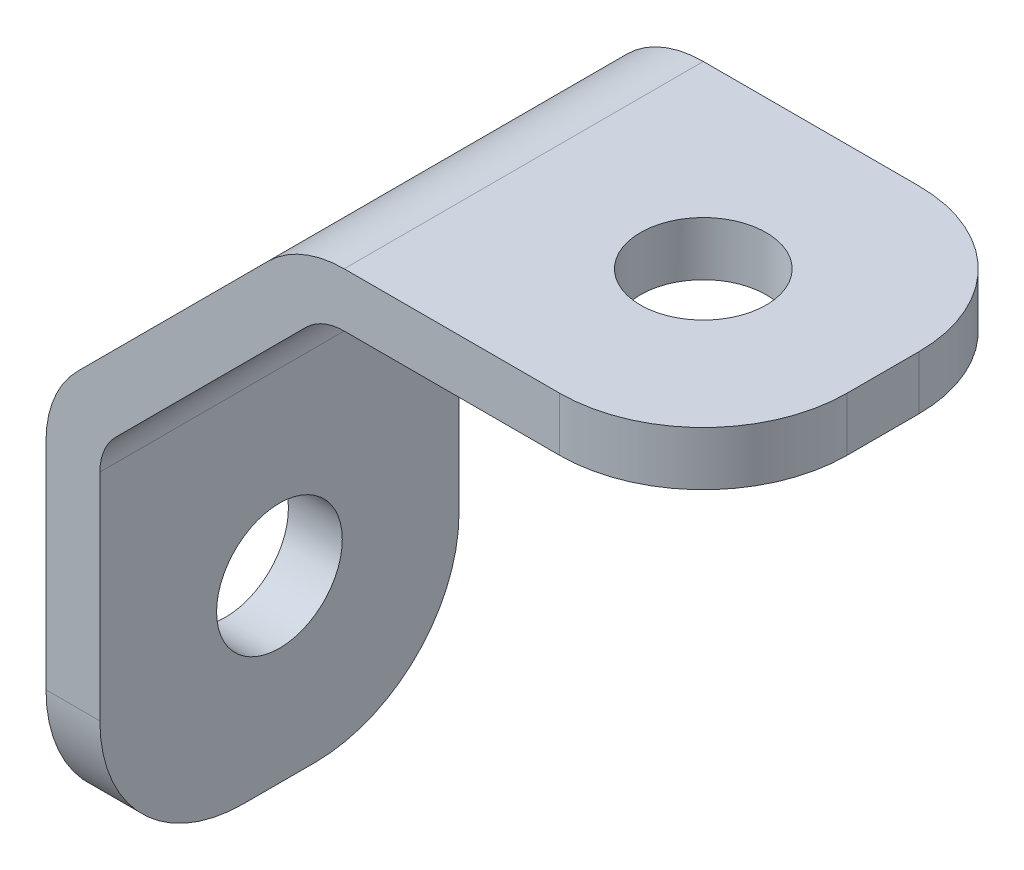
ISO-10303-21;
HEADER;
FILE_DESCRIPTION(('STEP AP214'),'2;1');
FILE_NAME('part.step','',(''),(''),'','','');
FILE_SCHEMA(('AUTOMOTIVE_DESIGN { 1 0 10303 214 1 1 1 1 }'));
ENDSEC;
DATA;
#1=APPLICATION_CONTEXT('core data for automotive mechanical design processes');
#2=APPLICATION_PROTOCOL_DEFINITION('international standard','automotive_design',2000,#1);
#3=PRODUCT_CONTEXT('',#1,'mechanical');
#4=PRODUCT('Part','Part','',(#3));
#5=PRODUCT_RELATED_PRODUCT_CATEGORY('part','',(#4));
#6=PRODUCT_DEFINITION_FORMATION('','',#4);
#7=PRODUCT_DEFINITION_CONTEXT('part definition',#1,'design');
#8=PRODUCT_DEFINITION('design','',#6,#7);
#9=PRODUCT_DEFINITION_SHAPE('','',#8);
#10=(LENGTH_UNIT() NAMED_UNIT(*) SI_UNIT(.MILLI.,.METRE.));
#11=(NAMED_UNIT(*) PLANE_ANGLE_UNIT() SI_UNIT($,.RADIAN.));
#12=(NAMED_UNIT(*) SI_UNIT($,.STERADIAN.) SOLID_ANGLE_UNIT());
#13=UNCERTAINTY_MEASURE_WITH_UNIT(LENGTH_MEASURE(1.E-05),#10,'distance_accuracy_value','');
#14=(GEOMETRIC_REPRESENTATION_CONTEXT(3) GLOBAL_UNCERTAINTY_ASSIGNED_CONTEXT((#13)) GLOBAL_UNIT_ASSIGNED_CONTEXT((#10,
#11,#12)) REPRESENTATION_CONTEXT('',''));
#15=CARTESIAN_POINT('',(0.,0.,0.));
#16=DIRECTION('',(0.,0.,1.));
#17=DIRECTION('',(1.,0.,0.));
#18=AXIS2_PLACEMENT_3D('',#15,#16,#17);
#19=CARTESIAN_POINT('',(35.1066017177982,23.6066017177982,10.));
#20=DIRECTION('',(0.,-1.,0.));
#21=DIRECTION('',(0.,0.,-1.));
#22=AXIS2_PLACEMENT_3D('',#19,#20,#21);
#23=PLANE('',#22);
#24=CARTESIAN_POINT('',(25.1066017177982,23.6066017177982,0.));
#25=DIRECTION('',(0.,-1.,0.));
#26=DIRECTION('',(0.,0.,-1.));
#27=AXIS2_PLACEMENT_3D('',#24,#25,#26);
#28=CIRCLE('',#27,3.5);
#29=CARTESIAN_POINT('',(25.1066017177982,23.6066017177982,-3.5));
#30=VERTEX_POINT('',#29);
#31=EDGE_CURVE('E294',#30,#30,#28,.T.);
#32=ORIENTED_EDGE('',*,*,#31,.F.);
#33=EDGE_LOOP('',(#32));
#34=FACE_BOUND('',#33,.T.);
#35=DIRECTION('',(-1.,0.,0.));
#36=VECTOR('',#35,1.);
#37=CARTESIAN_POINT('',(35.1066017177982,23.6066017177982,-10.));
#38=LINE('',#37,#36);
#39=CARTESIAN_POINT('',(27.1066017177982,23.6066017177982,-10.));
#40=VERTEX_POINT('',#39);
#41=CARTESIAN_POINT('',(15.1066017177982,23.6066017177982,-10.));
#42=VERTEX_POINT('',#41);
#43=EDGE_CURVE('E159',#40,#42,#38,.T.);
#44=ORIENTED_EDGE('',*,*,#43,.F.);
#45=CARTESIAN_POINT('',(27.1066017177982,23.6066017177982,-2.));
#46=DIRECTION('',(0.,-1.,0.));
#47=DIRECTION('',(0.,0.,-1.));
#48=AXIS2_PLACEMENT_3D('',#45,#46,#47);
#49=CIRCLE('',#48,8.);
#50=CARTESIAN_POINT('',(35.1066017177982,23.6066017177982,-2.));
#51=VERTEX_POINT('',#50);
#52=EDGE_CURVE('E45',#40,#51,#49,.T.);
#53=ORIENTED_EDGE('',*,*,#52,.T.);
#54=DIRECTION('',(0.,0.,-1.));
#55=VECTOR('',#54,1.);
#56=CARTESIAN_POINT('',(35.1066017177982,23.6066017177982,10.));
#57=LINE('',#56,#55);
#58=CARTESIAN_POINT('',(35.1066017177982,23.6066017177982,2.));
#59=VERTEX_POINT('',#58);
#60=EDGE_CURVE('E216',#59,#51,#57,.T.);
#61=ORIENTED_EDGE('',*,*,#60,.F.);
#62=CARTESIAN_POINT('',(27.1066017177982,23.6066017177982,2.));
#63=DIRECTION('',(0.,-1.,0.));
#64=DIRECTION('',(0.,0.,-1.));
#65=AXIS2_PLACEMENT_3D('',#62,#63,#64);
#66=CIRCLE('',#65,8.);
#67=CARTESIAN_POINT('',(27.1066017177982,23.6066017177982,10.));
#68=VERTEX_POINT('',#67);
#69=EDGE_CURVE('E288',#59,#68,#66,.T.);
#70=ORIENTED_EDGE('',*,*,#69,.T.);
#71=DIRECTION('',(-1.,0.,0.));
#72=VECTOR('',#71,1.);
#73=CARTESIAN_POINT('',(35.1066017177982,23.6066017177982,10.));
#74=LINE('',#73,#72);
#75=CARTESIAN_POINT('',(15.1066017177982,23.6066017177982,10.));
#76=VERTEX_POINT('',#75);
#77=EDGE_CURVE('E190',#68,#76,#74,.T.);
#78=ORIENTED_EDGE('',*,*,#77,.T.);
#79=DIRECTION('',(0.,0.,-1.));
#80=VECTOR('',#79,1.);
#81=CARTESIAN_POINT('',(15.1066017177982,23.6066017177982,10.));
#82=LINE('',#81,#80);
#83=EDGE_CURVE('E213',#76,#42,#82,.T.);
#84=ORIENTED_EDGE('',*,*,#83,.T.);
#85=EDGE_LOOP('',(#44,#53,#61,#70,#78,#84));
#86=FACE_BOUND('',#85,.T.);
#87=ADVANCED_FACE('F30',(#34,#86),#23,.T.);
#88=CARTESIAN_POINT('',(15.1066017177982,26.6066017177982,10.));
#89=DIRECTION('',(0.,1.,0.));
#90=DIRECTION('',(0.,0.,1.));
#91=AXIS2_PLACEMENT_3D('',#88,#89,#90);
#92=PLANE('',#91);
#93=CARTESIAN_POINT('',(25.1066017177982,26.6066017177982,0.));
#94=DIRECTION('',(0.,1.,0.));
#95=DIRECTION('',(0.,0.,1.));
#96=AXIS2_PLACEMENT_3D('',#93,#94,#95);
#97=CIRCLE('',#96,3.5);
#98=CARTESIAN_POINT('',(25.1066017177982,26.6066017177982,3.5));
#99=VERTEX_POINT('',#98);
#100=EDGE_CURVE('E290',#99,#99,#97,.T.);
#101=ORIENTED_EDGE('',*,*,#100,.F.);
#102=EDGE_LOOP('',(#101));
#103=FACE_BOUND('',#102,.T.);
#104=DIRECTION('',(0.,0.,-1.));
#105=VECTOR('',#104,1.);
#106=CARTESIAN_POINT('',(35.1066017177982,26.6066017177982,10.));
#107=LINE('',#106,#105);
#108=CARTESIAN_POINT('',(35.1066017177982,26.6066017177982,2.));
#109=VERTEX_POINT('',#108);
#110=CARTESIAN_POINT('',(35.1066017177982,26.6066017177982,-2.));
#111=VERTEX_POINT('',#110);
#112=EDGE_CURVE('E152',#109,#111,#107,.T.);
#113=ORIENTED_EDGE('',*,*,#112,.T.);
#114=CARTESIAN_POINT('',(27.1066017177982,26.6066017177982,-2.));
#115=DIRECTION('',(0.,1.,0.));
#116=DIRECTION('',(0.,0.,1.));
#117=AXIS2_PLACEMENT_3D('',#114,#115,#116);
#118=CIRCLE('',#117,8.);
#119=CARTESIAN_POINT('',(27.1066017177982,26.6066017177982,-10.));
#120=VERTEX_POINT('',#119);
#121=EDGE_CURVE('E141',#111,#120,#118,.T.);
#122=ORIENTED_EDGE('',*,*,#121,.T.);
#123=DIRECTION('',(1.,0.,0.));
#124=VECTOR('',#123,1.);
#125=CARTESIAN_POINT('',(15.1066017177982,26.6066017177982,-10.));
#126=LINE('',#125,#124);
#127=CARTESIAN_POINT('',(15.1066017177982,26.6066017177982,-10.));
#128=VERTEX_POINT('',#127);
#129=EDGE_CURVE('E150',#128,#120,#126,.T.);
#130=ORIENTED_EDGE('',*,*,#129,.F.);
#131=DIRECTION('',(0.,0.,-1.));
#132=VECTOR('',#131,1.);
#133=CARTESIAN_POINT('',(15.1066017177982,26.6066017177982,10.));
#134=LINE('',#133,#132);
#135=CARTESIAN_POINT('',(15.1066017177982,26.6066017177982,10.));
#136=VERTEX_POINT('',#135);
#137=EDGE_CURVE('E220',#136,#128,#134,.T.);
#138=ORIENTED_EDGE('',*,*,#137,.F.);
#139=DIRECTION('',(1.,0.,0.));
#140=VECTOR('',#139,1.);
#141=CARTESIAN_POINT('',(15.1066017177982,26.6066017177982,10.));
#142=LINE('',#141,#140);
#143=CARTESIAN_POINT('',(27.1066017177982,26.6066017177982,10.));
#144=VERTEX_POINT('',#143);
#145=EDGE_CURVE('E187',#136,#144,#142,.T.);
#146=ORIENTED_EDGE('',*,*,#145,.T.);
#147=CARTESIAN_POINT('',(27.1066017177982,26.6066017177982,2.));
#148=DIRECTION('',(0.,1.,0.));
#149=DIRECTION('',(0.,0.,1.));
#150=AXIS2_PLACEMENT_3D('',#147,#148,#149);
#151=CIRCLE('',#150,8.);
#152=EDGE_CURVE('E52',#144,#109,#151,.T.);
#153=ORIENTED_EDGE('',*,*,#152,.T.);
#154=EDGE_LOOP('',(#113,#122,#130,#138,#146,#153));
#155=FACE_BOUND('',#154,.T.);
#156=ADVANCED_FACE('F149',(#103,#155),#92,.T.);
#157=CARTESIAN_POINT('',(4.5,10.,10.));
#158=DIRECTION('',(0.,0.,1.));
#159=DIRECTION('',(1.,0.,0.));
#160=AXIS2_PLACEMENT_3D('',#157,#158,#159);
#161=PLANE('',#160);
#162=ORIENTED_EDGE('',*,*,#77,.F.);
#163=DIRECTION('',(0.,1.,0.));
#164=VECTOR('',#163,1.);
#165=CARTESIAN_POINT('',(27.1066017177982,-10.,10.));
#166=LINE('',#165,#164);
#167=EDGE_CURVE('E38',#68,#144,#166,.T.);
#168=ORIENTED_EDGE('',*,*,#167,.T.);
#169=ORIENTED_EDGE('',*,*,#145,.F.);
#170=CARTESIAN_POINT('',(15.1066017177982,20.6066017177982,10.));
#171=DIRECTION('',(0.,0.,1.));
#172=DIRECTION('',(1.,0.,0.));
#173=AXIS2_PLACEMENT_3D('',#170,#171,#172);
#174=CIRCLE('',#173,6.);
#175=CARTESIAN_POINT('',(10.863961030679,24.8492424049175,10.));
#176=VERTEX_POINT('',#175);
#177=EDGE_CURVE('E185',#136,#176,#174,.T.);
#178=ORIENTED_EDGE('',*,*,#177,.T.);
#179=DIRECTION('',(-0.707106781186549,-0.707106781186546,0.));
#180=VECTOR('',#179,1.);
#181=CARTESIAN_POINT('',(10.863961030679,24.8492424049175,10.));
#182=LINE('',#181,#180);
#183=CARTESIAN_POINT('',(0.257359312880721,14.2426406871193,10.));
#184=VERTEX_POINT('',#183);
#185=EDGE_CURVE('E183',#176,#184,#182,.T.);
#186=ORIENTED_EDGE('',*,*,#185,.T.);
#187=CARTESIAN_POINT('',(4.5,10.,10.));
#188=DIRECTION('',(0.,0.,1.));
#189=DIRECTION('',(1.,0.,0.));
#190=AXIS2_PLACEMENT_3D('',#187,#188,#189);
#191=CIRCLE('',#190,6.);
#192=CARTESIAN_POINT('',(-1.5,10.,10.));
#193=VERTEX_POINT('',#192);
#194=EDGE_CURVE('E181',#184,#193,#191,.T.);
#195=ORIENTED_EDGE('',*,*,#194,.T.);
#196=DIRECTION('',(0.,-1.,0.));
#197=VECTOR('',#196,1.);
#198=CARTESIAN_POINT('',(-1.5,10.,10.));
#199=LINE('',#198,#197);
#200=CARTESIAN_POINT('',(-1.5,-2.00000000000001,10.));
#201=VERTEX_POINT('',#200);
#202=EDGE_CURVE('E178',#193,#201,#199,.T.);
#203=ORIENTED_EDGE('',*,*,#202,.T.);
#204=DIRECTION('',(-1.,0.,0.));
#205=VECTOR('',#204,1.);
#206=CARTESIAN_POINT('',(35.1066017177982,-2.00000000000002,10.));
#207=LINE('',#206,#205);
#208=CARTESIAN_POINT('',(1.5,-2.00000000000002,10.));
#209=VERTEX_POINT('',#208);
#210=EDGE_CURVE('E234',#209,#201,#207,.T.);
#211=ORIENTED_EDGE('',*,*,#210,.F.);
#212=DIRECTION('',(0.,-1.,0.));
#213=VECTOR('',#212,1.);
#214=CARTESIAN_POINT('',(1.5,10.,10.));
#215=LINE('',#214,#213);
#216=CARTESIAN_POINT('',(1.5,10.,10.));
#217=VERTEX_POINT('',#216);
#218=EDGE_CURVE('E200',#217,#209,#215,.T.);
#219=ORIENTED_EDGE('',*,*,#218,.F.);
#220=CARTESIAN_POINT('',(4.5,10.,10.));
#221=DIRECTION('',(0.,0.,-1.));
#222=DIRECTION('',(-1.,0.,0.));
#223=AXIS2_PLACEMENT_3D('',#220,#221,#222);
#224=CIRCLE('',#223,3.);
#225=CARTESIAN_POINT('',(2.37867965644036,12.1213203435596,10.));
#226=VERTEX_POINT('',#225);
#227=EDGE_CURVE('E198',#217,#226,#224,.T.);
#228=ORIENTED_EDGE('',*,*,#227,.T.);
#229=DIRECTION('',(-0.707106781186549,-0.707106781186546,0.));
#230=VECTOR('',#229,1.);
#231=CARTESIAN_POINT('',(12.9852813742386,22.7279220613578,10.));
#232=LINE('',#231,#230);
#233=CARTESIAN_POINT('',(12.9852813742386,22.7279220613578,10.));
#234=VERTEX_POINT('',#233);
#235=EDGE_CURVE('E195',#234,#226,#232,.T.);
#236=ORIENTED_EDGE('',*,*,#235,.F.);
#237=CARTESIAN_POINT('',(15.1066017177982,20.6066017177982,10.));
#238=DIRECTION('',(0.,0.,-1.));
#239=DIRECTION('',(-1.,0.,0.));
#240=AXIS2_PLACEMENT_3D('',#237,#238,#239);
#241=CIRCLE('',#240,3.);
#242=EDGE_CURVE('E192',#234,#76,#241,.T.);
#243=ORIENTED_EDGE('',*,*,#242,.T.);
#244=EDGE_LOOP('',(#162,#168,#169,#178,#186,#195,#203,#211,#219,#228,#236,#243));
#245=FACE_BOUND('',#244,.T.);
#246=ADVANCED_FACE('F238',(#245),#161,.T.);
#247=CARTESIAN_POINT('',(1.5,10.,10.));
#248=DIRECTION('',(1.,0.,0.));
#249=DIRECTION('',(0.,1.,0.));
#250=AXIS2_PLACEMENT_3D('',#247,#248,#249);
#251=PLANE('',#250);
#252=CARTESIAN_POINT('',(1.5,0.,0.));
#253=DIRECTION('',(1.,0.,0.));
#254=DIRECTION('',(0.,1.,0.));
#255=AXIS2_PLACEMENT_3D('',#252,#253,#254);
#256=CIRCLE('',#255,3.5);
#257=CARTESIAN_POINT('',(1.5,3.5,0.));
#258=VERTEX_POINT('',#257);
#259=EDGE_CURVE('E317',#258,#258,#256,.T.);
#260=ORIENTED_EDGE('',*,*,#259,.F.);
#261=EDGE_LOOP('',(#260));
#262=FACE_BOUND('',#261,.T.);
#263=ORIENTED_EDGE('',*,*,#218,.T.);
#264=CARTESIAN_POINT('',(1.5,-2.,2.));
#265=DIRECTION('',(1.,0.,0.));
#266=DIRECTION('',(0.,1.,0.));
#267=AXIS2_PLACEMENT_3D('',#264,#265,#266);
#268=CIRCLE('',#267,8.);
#269=CARTESIAN_POINT('',(1.49999999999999,-10.,2.));
#270=VERTEX_POINT('',#269);
#271=EDGE_CURVE('E268',#209,#270,#268,.T.);
#272=ORIENTED_EDGE('',*,*,#271,.T.);
#273=DIRECTION('',(0.,0.,-1.));
#274=VECTOR('',#273,1.);
#275=CARTESIAN_POINT('',(1.49999999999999,-10.,10.));
#276=LINE('',#275,#274);
#277=CARTESIAN_POINT('',(1.49999999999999,-10.,-2.00000000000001));
#278=VERTEX_POINT('',#277);
#279=EDGE_CURVE('E204',#270,#278,#276,.T.);
#280=ORIENTED_EDGE('',*,*,#279,.T.);
#281=CARTESIAN_POINT('',(1.5,-2.,-2.));
#282=DIRECTION('',(1.,0.,0.));
#283=DIRECTION('',(0.,1.,0.));
#284=AXIS2_PLACEMENT_3D('',#281,#282,#283);
#285=CIRCLE('',#284,8.);
#286=CARTESIAN_POINT('',(1.49999999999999,-2.00000000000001,-10.));
#287=VERTEX_POINT('',#286);
#288=EDGE_CURVE('E312',#278,#287,#285,.T.);
#289=ORIENTED_EDGE('',*,*,#288,.T.);
#290=DIRECTION('',(0.,-1.,0.));
#291=VECTOR('',#290,1.);
#292=CARTESIAN_POINT('',(1.5,10.,-10.));
#293=LINE('',#292,#291);
#294=CARTESIAN_POINT('',(1.5,10.,-10.));
#295=VERTEX_POINT('',#294);
#296=EDGE_CURVE('E175',#295,#287,#293,.T.);
#297=ORIENTED_EDGE('',*,*,#296,.F.);
#298=DIRECTION('',(0.,0.,-1.));
#299=VECTOR('',#298,1.);
#300=CARTESIAN_POINT('',(1.5,10.,10.));
#301=LINE('',#300,#299);
#302=EDGE_CURVE('E207',#217,#295,#301,.T.);
#303=ORIENTED_EDGE('',*,*,#302,.F.);
#304=EDGE_LOOP('',(#263,#272,#280,#289,#297,#303));
#305=FACE_BOUND('',#304,.T.);
#306=ADVANCED_FACE('F267',(#262,#305),#251,.T.);
#307=CARTESIAN_POINT('',(-1.5,10.,10.));
#308=DIRECTION('',(1.,0.,0.));
#309=DIRECTION('',(0.,1.,0.));
#310=AXIS2_PLACEMENT_3D('',#307,#308,#309);
#311=PLANE('',#310);
#312=CARTESIAN_POINT('',(-1.5,0.,0.));
#313=DIRECTION('',(-1.,0.,0.));
#314=DIRECTION('',(0.,-1.,0.));
#315=AXIS2_PLACEMENT_3D('',#312,#313,#314);
#316=CIRCLE('',#315,3.5);
#317=CARTESIAN_POINT('',(-1.5,-3.5,0.));
#318=VERTEX_POINT('',#317);
#319=EDGE_CURVE('E314',#318,#318,#316,.T.);
#320=ORIENTED_EDGE('',*,*,#319,.F.);
#321=EDGE_LOOP('',(#320));
#322=FACE_BOUND('',#321,.T.);
#323=CARTESIAN_POINT('',(-1.5,-2.,2.));
#324=DIRECTION('',(-1.,0.,0.));
#325=DIRECTION('',(0.,-1.,0.));
#326=AXIS2_PLACEMENT_3D('',#323,#324,#325);
#327=CIRCLE('',#326,8.);
#328=CARTESIAN_POINT('',(-1.5,-10.,2.));
#329=VERTEX_POINT('',#328);
#330=EDGE_CURVE('E261',#329,#201,#327,.T.);
#331=ORIENTED_EDGE('',*,*,#330,.T.);
#332=ORIENTED_EDGE('',*,*,#202,.F.);
#333=DIRECTION('',(0.,0.,-1.));
#334=VECTOR('',#333,1.);
#335=CARTESIAN_POINT('',(-1.5,10.,10.));
#336=LINE('',#335,#334);
#337=CARTESIAN_POINT('',(-1.5,10.,-10.));
#338=VERTEX_POINT('',#337);
#339=EDGE_CURVE('E228',#193,#338,#336,.T.);
#340=ORIENTED_EDGE('',*,*,#339,.T.);
#341=DIRECTION('',(0.,-1.,0.));
#342=VECTOR('',#341,1.);
#343=CARTESIAN_POINT('',(-1.5,10.,-10.));
#344=LINE('',#343,#342);
#345=CARTESIAN_POINT('',(-1.5,-2.00000000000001,-10.));
#346=VERTEX_POINT('',#345);
#347=EDGE_CURVE('E320',#338,#346,#344,.T.);
#348=ORIENTED_EDGE('',*,*,#347,.T.);
#349=CARTESIAN_POINT('',(-1.5,-2.,-2.));
#350=DIRECTION('',(-1.,0.,0.));
#351=DIRECTION('',(0.,-1.,0.));
#352=AXIS2_PLACEMENT_3D('',#349,#350,#351);
#353=CIRCLE('',#352,8.);
#354=CARTESIAN_POINT('',(-1.5,-10.,-2.00000000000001));
#355=VERTEX_POINT('',#354);
#356=EDGE_CURVE('E306',#346,#355,#353,.T.);
#357=ORIENTED_EDGE('',*,*,#356,.T.);
#358=DIRECTION('',(0.,0.,-1.));
#359=VECTOR('',#358,1.);
#360=CARTESIAN_POINT('',(-1.5,-10.,10.));
#361=LINE('',#360,#359);
#362=EDGE_CURVE('E203',#329,#355,#361,.T.);
#363=ORIENTED_EDGE('',*,*,#362,.F.);
#364=EDGE_LOOP('',(#331,#332,#340,#348,#357,#363));
#365=FACE_BOUND('',#364,.T.);
#366=ADVANCED_FACE('F259',(#322,#365),#311,.F.);
#367=CARTESIAN_POINT('',(1.49999999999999,-10.,10.));
#368=DIRECTION('',(0.,-1.,0.));
#369=DIRECTION('',(0.,0.,-1.));
#370=AXIS2_PLACEMENT_3D('',#367,#368,#369);
#371=PLANE('',#370);
#372=DIRECTION('',(-1.,0.,0.));
#373=VECTOR('',#372,1.);
#374=CARTESIAN_POINT('',(35.1066017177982,-10.,2.));
#375=LINE('',#374,#373);
#376=EDGE_CURVE('E302',#270,#329,#375,.T.);
#377=ORIENTED_EDGE('',*,*,#376,.T.);
#378=ORIENTED_EDGE('',*,*,#362,.T.);
#379=DIRECTION('',(-1.,0.,0.));
#380=VECTOR('',#379,1.);
#381=CARTESIAN_POINT('',(35.1066017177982,-10.,-2.00000000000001));
#382=LINE('',#381,#380);
#383=EDGE_CURVE('E309',#278,#355,#382,.T.);
#384=ORIENTED_EDGE('',*,*,#383,.F.);
#385=ORIENTED_EDGE('',*,*,#279,.F.);
#386=EDGE_LOOP('',(#377,#378,#384,#385));
#387=FACE_BOUND('',#386,.T.);
#388=ADVANCED_FACE('F32',(#387),#371,.T.);
#389=CARTESIAN_POINT('',(4.5,10.,10.));
#390=DIRECTION('',(0.,0.,-1.));
#391=DIRECTION('',(-1.,0.,0.));
#392=AXIS2_PLACEMENT_3D('',#389,#390,#391);
#393=CYLINDRICAL_SURFACE('',#392,3.);
#394=CARTESIAN_POINT('',(4.5,10.,-10.));
#395=DIRECTION('',(0.,0.,-1.));
#396=DIRECTION('',(-1.,0.,0.));
#397=AXIS2_PLACEMENT_3D('',#394,#395,#396);
#398=CIRCLE('',#397,3.);
#399=CARTESIAN_POINT('',(2.37867965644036,12.1213203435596,-10.));
#400=VERTEX_POINT('',#399);
#401=EDGE_CURVE('E172',#295,#400,#398,.T.);
#402=ORIENTED_EDGE('',*,*,#401,.T.);
#403=DIRECTION('',(0.,0.,-1.));
#404=VECTOR('',#403,1.);
#405=CARTESIAN_POINT('',(2.37867965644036,12.1213203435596,10.));
#406=LINE('',#405,#404);
#407=EDGE_CURVE('E209',#226,#400,#406,.T.);
#408=ORIENTED_EDGE('',*,*,#407,.F.);
#409=ORIENTED_EDGE('',*,*,#227,.F.);
#410=ORIENTED_EDGE('',*,*,#302,.T.);
#411=EDGE_LOOP('',(#402,#408,#409,#410));
#412=FACE_BOUND('',#411,.T.);
#413=ADVANCED_FACE('F276',(#412),#393,.F.);
#414=CARTESIAN_POINT('',(12.9852813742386,22.7279220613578,10.));
#415=DIRECTION('',(0.707106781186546,-0.707106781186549,0.));
#416=DIRECTION('',(0.707106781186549,0.707106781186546,0.));
#417=AXIS2_PLACEMENT_3D('',#414,#415,#416);
#418=PLANE('',#417);
#419=DIRECTION('',(-0.707106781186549,-0.707106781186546,0.));
#420=VECTOR('',#419,1.);
#421=CARTESIAN_POINT('',(12.9852813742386,22.7279220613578,-10.));
#422=LINE('',#421,#420);
#423=CARTESIAN_POINT('',(12.9852813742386,22.7279220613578,-10.));
#424=VERTEX_POINT('',#423);
#425=EDGE_CURVE('E169',#424,#400,#422,.T.);
#426=ORIENTED_EDGE('',*,*,#425,.F.);
#427=DIRECTION('',(0.,0.,-1.));
#428=VECTOR('',#427,1.);
#429=CARTESIAN_POINT('',(12.9852813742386,22.7279220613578,10.));
#430=LINE('',#429,#428);
#431=EDGE_CURVE('E211',#234,#424,#430,.T.);
#432=ORIENTED_EDGE('',*,*,#431,.F.);
#433=ORIENTED_EDGE('',*,*,#235,.T.);
#434=ORIENTED_EDGE('',*,*,#407,.T.);
#435=EDGE_LOOP('',(#426,#432,#433,#434));
#436=FACE_BOUND('',#435,.T.);
#437=ADVANCED_FACE('F282',(#436),#418,.T.);
#438=CARTESIAN_POINT('',(15.1066017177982,20.6066017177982,10.));
#439=DIRECTION('',(0.,0.,-1.));
#440=DIRECTION('',(-1.,0.,0.));
#441=AXIS2_PLACEMENT_3D('',#438,#439,#440);
#442=CYLINDRICAL_SURFACE('',#441,3.);
#443=CARTESIAN_POINT('',(15.1066017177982,20.6066017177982,-10.));
#444=DIRECTION('',(0.,0.,-1.));
#445=DIRECTION('',(-1.,0.,0.));
#446=AXIS2_PLACEMENT_3D('',#443,#444,#445);
#447=CIRCLE('',#446,3.);
#448=EDGE_CURVE('E161',#424,#42,#447,.T.);
#449=ORIENTED_EDGE('',*,*,#448,.T.);
#450=ORIENTED_EDGE('',*,*,#83,.F.);
#451=ORIENTED_EDGE('',*,*,#242,.F.);
#452=ORIENTED_EDGE('',*,*,#431,.T.);
#453=EDGE_LOOP('',(#449,#450,#451,#452));
#454=FACE_BOUND('',#453,.T.);
#455=ADVANCED_FACE('F285',(#454),#442,.F.);
#456=CARTESIAN_POINT('',(35.1066017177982,26.6066017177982,10.));
#457=DIRECTION('',(1.,0.,0.));
#458=DIRECTION('',(0.,0.,-1.));
#459=AXIS2_PLACEMENT_3D('',#456,#457,#458);
#460=PLANE('',#459);
#461=DIRECTION('',(0.,1.,0.));
#462=VECTOR('',#461,1.);
#463=CARTESIAN_POINT('',(35.1066017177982,-10.,-2.));
#464=LINE('',#463,#462);
#465=EDGE_CURVE('E153',#51,#111,#464,.T.);
#466=ORIENTED_EDGE('',*,*,#465,.T.);
#467=ORIENTED_EDGE('',*,*,#112,.F.);
#468=DIRECTION('',(0.,1.,0.));
#469=VECTOR('',#468,1.);
#470=CARTESIAN_POINT('',(35.1066017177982,-10.,2.));
#471=LINE('',#470,#469);
#472=EDGE_CURVE('E291',#59,#109,#471,.T.);
#473=ORIENTED_EDGE('',*,*,#472,.F.);
#474=ORIENTED_EDGE('',*,*,#60,.T.);
#475=EDGE_LOOP('',(#466,#467,#473,#474));
#476=FACE_BOUND('',#475,.T.);
#477=ADVANCED_FACE('F352',(#476),#460,.T.);
#478=CARTESIAN_POINT('',(15.1066017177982,20.6066017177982,10.));
#479=DIRECTION('',(0.,0.,-1.));
#480=DIRECTION('',(-1.,0.,0.));
#481=AXIS2_PLACEMENT_3D('',#478,#479,#480);
#482=CYLINDRICAL_SURFACE('',#481,6.);
#483=CARTESIAN_POINT('',(15.1066017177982,20.6066017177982,-10.));
#484=DIRECTION('',(0.,0.,1.));
#485=DIRECTION('',(1.,0.,0.));
#486=AXIS2_PLACEMENT_3D('',#483,#484,#485);
#487=CIRCLE('',#486,6.);
#488=CARTESIAN_POINT('',(10.863961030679,24.8492424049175,-10.));
#489=VERTEX_POINT('',#488);
#490=EDGE_CURVE('E158',#128,#489,#487,.T.);
#491=ORIENTED_EDGE('',*,*,#490,.T.);
#492=DIRECTION('',(0.,0.,-1.));
#493=VECTOR('',#492,1.);
#494=CARTESIAN_POINT('',(10.863961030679,24.8492424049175,10.));
#495=LINE('',#494,#493);
#496=EDGE_CURVE('E222',#176,#489,#495,.T.);
#497=ORIENTED_EDGE('',*,*,#496,.F.);
#498=ORIENTED_EDGE('',*,*,#177,.F.);
#499=ORIENTED_EDGE('',*,*,#137,.T.);
#500=EDGE_LOOP('',(#491,#497,#498,#499));
#501=FACE_BOUND('',#500,.T.);
#502=ADVANCED_FACE('F243',(#501),#482,.T.);
#503=CARTESIAN_POINT('',(10.863961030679,24.8492424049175,10.));
#504=DIRECTION('',(0.707106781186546,-0.707106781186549,0.));
#505=DIRECTION('',(0.707106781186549,0.707106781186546,0.));
#506=AXIS2_PLACEMENT_3D('',#503,#504,#505);
#507=PLANE('',#506);
#508=DIRECTION('',(-0.707106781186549,-0.707106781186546,0.));
#509=VECTOR('',#508,1.);
#510=CARTESIAN_POINT('',(10.863961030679,24.8492424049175,-10.));
#511=LINE('',#510,#509);
#512=CARTESIAN_POINT('',(0.257359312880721,14.2426406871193,-10.));
#513=VERTEX_POINT('',#512);
#514=EDGE_CURVE('E163',#489,#513,#511,.T.);
#515=ORIENTED_EDGE('',*,*,#514,.T.);
#516=DIRECTION('',(0.,0.,-1.));
#517=VECTOR('',#516,1.);
#518=CARTESIAN_POINT('',(0.257359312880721,14.2426406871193,10.));
#519=LINE('',#518,#517);
#520=EDGE_CURVE('E225',#184,#513,#519,.T.);
#521=ORIENTED_EDGE('',*,*,#520,.F.);
#522=ORIENTED_EDGE('',*,*,#185,.F.);
#523=ORIENTED_EDGE('',*,*,#496,.T.);
#524=EDGE_LOOP('',(#515,#521,#522,#523));
#525=FACE_BOUND('',#524,.T.);
#526=ADVANCED_FACE('F249',(#525),#507,.F.);
#527=CARTESIAN_POINT('',(4.5,10.,10.));
#528=DIRECTION('',(0.,0.,-1.));
#529=DIRECTION('',(-1.,0.,0.));
#530=AXIS2_PLACEMENT_3D('',#527,#528,#529);
#531=CYLINDRICAL_SURFACE('',#530,6.);
#532=CARTESIAN_POINT('',(4.5,10.,-10.));
#533=DIRECTION('',(0.,0.,1.));
#534=DIRECTION('',(1.,0.,0.));
#535=AXIS2_PLACEMENT_3D('',#532,#533,#534);
#536=CIRCLE('',#535,6.);
#537=EDGE_CURVE('E254',#513,#338,#536,.T.);
#538=ORIENTED_EDGE('',*,*,#537,.T.);
#539=ORIENTED_EDGE('',*,*,#339,.F.);
#540=ORIENTED_EDGE('',*,*,#194,.F.);
#541=ORIENTED_EDGE('',*,*,#520,.T.);
#542=EDGE_LOOP('',(#538,#539,#540,#541));
#543=FACE_BOUND('',#542,.T.);
#544=ADVANCED_FACE('F252',(#543),#531,.T.);
#545=CARTESIAN_POINT('',(4.5,10.,-10.));
#546=DIRECTION('',(0.,0.,1.));
#547=DIRECTION('',(1.,0.,0.));
#548=AXIS2_PLACEMENT_3D('',#545,#546,#547);
#549=PLANE('',#548);
#550=ORIENTED_EDGE('',*,*,#129,.T.);
#551=DIRECTION('',(0.,1.,0.));
#552=VECTOR('',#551,1.);
#553=CARTESIAN_POINT('',(27.1066017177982,-10.,-10.));
#554=LINE('',#553,#552);
#555=EDGE_CURVE('E11',#120,#40,#554,.F.);
#556=ORIENTED_EDGE('',*,*,#555,.T.);
#557=ORIENTED_EDGE('',*,*,#43,.T.);
#558=ORIENTED_EDGE('',*,*,#448,.F.);
#559=ORIENTED_EDGE('',*,*,#425,.T.);
#560=ORIENTED_EDGE('',*,*,#401,.F.);
#561=ORIENTED_EDGE('',*,*,#296,.T.);
#562=DIRECTION('',(-1.,0.,0.));
#563=VECTOR('',#562,1.);
#564=CARTESIAN_POINT('',(35.1066017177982,-2.00000000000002,-10.));
#565=LINE('',#564,#563);
#566=EDGE_CURVE('E206',#287,#346,#565,.T.);
#567=ORIENTED_EDGE('',*,*,#566,.T.);
#568=ORIENTED_EDGE('',*,*,#347,.F.);
#569=ORIENTED_EDGE('',*,*,#537,.F.);
#570=ORIENTED_EDGE('',*,*,#514,.F.);
#571=ORIENTED_EDGE('',*,*,#490,.F.);
#572=EDGE_LOOP('',(#550,#556,#557,#558,#559,#560,#561,#567,#568,#569,#570,#571));
#573=FACE_BOUND('',#572,.T.);
#574=ADVANCED_FACE('F156',(#573),#549,.F.);
#575=CARTESIAN_POINT('',(35.1066017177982,0.,0.));
#576=DIRECTION('',(-1.,0.,0.));
#577=DIRECTION('',(0.,-1.,0.));
#578=AXIS2_PLACEMENT_3D('',#575,#576,#577);
#579=CYLINDRICAL_SURFACE('',#578,3.5);
#580=ORIENTED_EDGE('',*,*,#259,.T.);
#581=EDGE_LOOP('',(#580));
#582=FACE_BOUND('',#581,.T.);
#583=ORIENTED_EDGE('',*,*,#319,.T.);
#584=EDGE_LOOP('',(#583));
#585=FACE_BOUND('',#584,.T.);
#586=ADVANCED_FACE('F338',(#582,#585),#579,.F.);
#587=CARTESIAN_POINT('',(35.1066017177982,-2.,-2.));
#588=DIRECTION('',(-1.,0.,0.));
#589=DIRECTION('',(0.,-1.,0.));
#590=AXIS2_PLACEMENT_3D('',#587,#588,#589);
#591=CYLINDRICAL_SURFACE('',#590,8.);
#592=ORIENTED_EDGE('',*,*,#383,.T.);
#593=ORIENTED_EDGE('',*,*,#356,.F.);
#594=ORIENTED_EDGE('',*,*,#566,.F.);
#595=ORIENTED_EDGE('',*,*,#288,.F.);
#596=EDGE_LOOP('',(#592,#593,#594,#595));
#597=FACE_BOUND('',#596,.T.);
#598=ADVANCED_FACE('F324',(#597),#591,.T.);
#599=CARTESIAN_POINT('',(35.1066017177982,-2.,2.));
#600=DIRECTION('',(-1.,0.,0.));
#601=DIRECTION('',(0.,-1.,0.));
#602=AXIS2_PLACEMENT_3D('',#599,#600,#601);
#603=CYLINDRICAL_SURFACE('',#602,8.);
#604=ORIENTED_EDGE('',*,*,#210,.T.);
#605=ORIENTED_EDGE('',*,*,#330,.F.);
#606=ORIENTED_EDGE('',*,*,#376,.F.);
#607=ORIENTED_EDGE('',*,*,#271,.F.);
#608=EDGE_LOOP('',(#604,#605,#606,#607));
#609=FACE_BOUND('',#608,.T.);
#610=ADVANCED_FACE('F327',(#609),#603,.T.);
#611=CARTESIAN_POINT('',(25.1066017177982,-10.,0.));
#612=DIRECTION('',(0.,1.,0.));
#613=DIRECTION('',(0.,0.,1.));
#614=AXIS2_PLACEMENT_3D('',#611,#612,#613);
#615=CYLINDRICAL_SURFACE('',#614,3.5);
#616=ORIENTED_EDGE('',*,*,#31,.T.);
#617=EDGE_LOOP('',(#616));
#618=FACE_BOUND('',#617,.T.);
#619=ORIENTED_EDGE('',*,*,#100,.T.);
#620=EDGE_LOOP('',(#619));
#621=FACE_BOUND('',#620,.T.);
#622=ADVANCED_FACE('F329',(#618,#621),#615,.F.);
#623=CARTESIAN_POINT('',(27.1066017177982,-10.,2.));
#624=DIRECTION('',(0.,1.,0.));
#625=DIRECTION('',(0.,0.,1.));
#626=AXIS2_PLACEMENT_3D('',#623,#624,#625);
#627=CYLINDRICAL_SURFACE('',#626,8.);
#628=ORIENTED_EDGE('',*,*,#472,.T.);
#629=ORIENTED_EDGE('',*,*,#152,.F.);
#630=ORIENTED_EDGE('',*,*,#167,.F.);
#631=ORIENTED_EDGE('',*,*,#69,.F.);
#632=EDGE_LOOP('',(#628,#629,#630,#631));
#633=FACE_BOUND('',#632,.T.);
#634=ADVANCED_FACE('F335',(#633),#627,.T.);
#635=CARTESIAN_POINT('',(27.1066017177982,-10.,-2.));
#636=DIRECTION('',(0.,1.,0.));
#637=DIRECTION('',(0.,0.,1.));
#638=AXIS2_PLACEMENT_3D('',#635,#636,#637);
#639=CYLINDRICAL_SURFACE('',#638,8.);
#640=ORIENTED_EDGE('',*,*,#555,.F.);
#641=ORIENTED_EDGE('',*,*,#121,.F.);
#642=ORIENTED_EDGE('',*,*,#465,.F.);
#643=ORIENTED_EDGE('',*,*,#52,.F.);
#644=EDGE_LOOP('',(#640,#641,#642,#643));
#645=FACE_BOUND('',#644,.T.);
#646=ADVANCED_FACE('F140',(#645),#639,.T.);
#647=CLOSED_SHELL('',(#87,#156,#246,#306,#366,#388,#413,#437,#455,#477,#502,#526,#544,#574,#586,
#598,#610,#622,#634,#646));
#648=MANIFOLD_SOLID_BREP('B2',#647);
#649=ADVANCED_BREP_SHAPE_REPRESENTATION('',(#18,#648),#14);
#650=SHAPE_DEFINITION_REPRESENTATION(#9,#649);
ENDSEC;
END-ISO-10303-21;
